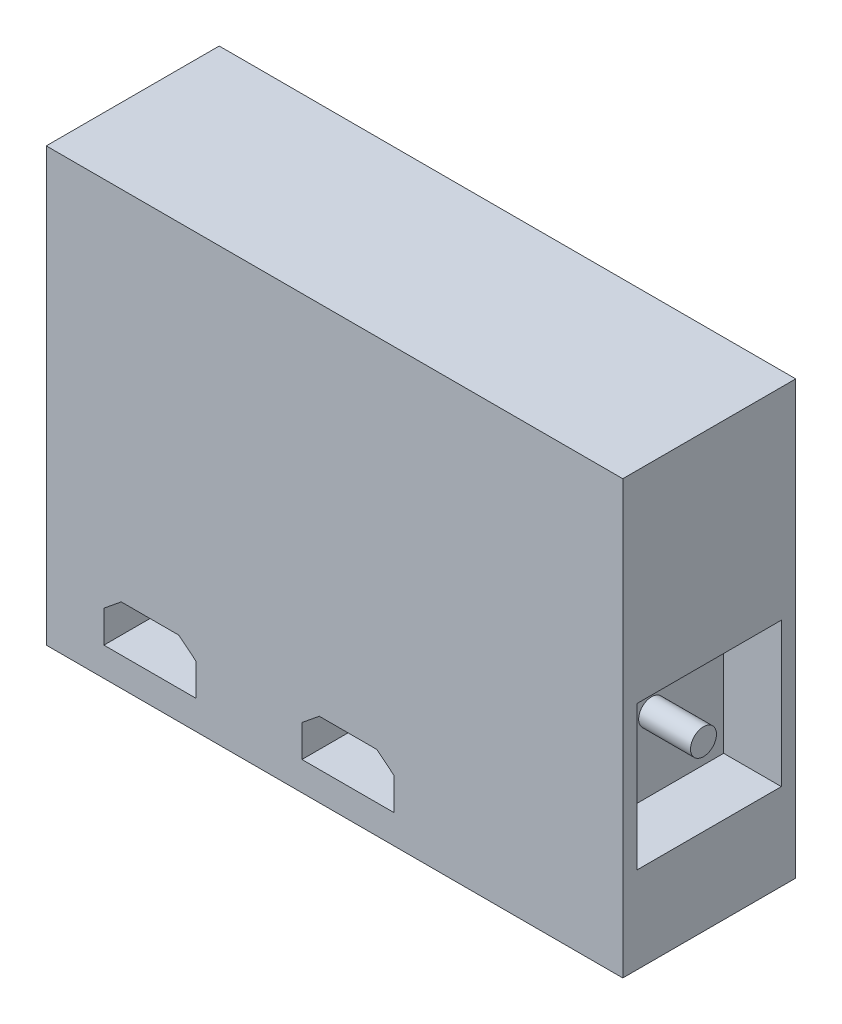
from build123d import *

# Parameters (mm, degrees)
SKETCH1_W          = 100
SKETCH1_H          = 75
BASE_EXTRUDE_DEPTH = 30
CUT_EXTRUDE1_DEPTH = 20
SKETCH6_W          = 25
SKETCH6_H          = 25
SKETCH6_R          = 2.25
CUT_EXTRUDE4_DEPTH = 10
SKETCH7_R          = 2.25
CUT_EXTRUDE5_DEPTH = 1


with BuildPart() as part:
    # Sketch1 → Base-Extrude (new body)
    with BuildSketch(Plane.XY):
        Rectangle(SKETCH1_W, SKETCH1_H)
    extrude(amount=BASE_EXTRUDE_DEPTH)

    # Sketch2 → Cut-Extrude1 (cut)
    with BuildSketch(Plane.XY.offset(30)):
        Polygon((-40, -26.94262182), (-40, -32.5), (-24, -32.5), (-24, -26.94262182), (-27, -24.5), (-37, -24.5), align=None)
        Polygon((-2.647451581, -24.5), (-5.647451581, -26.94262182), (-5.647451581, -32.5), (10.352548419, -32.5), (10.352548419, -26.94262182), (7.352548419, -24.5), align=None)
    extrude(amount=-CUT_EXTRUDE1_DEPTH, mode=Mode.SUBTRACT)

    # Sketch6 → Cut-Extrude4 (cut)
    with BuildSketch(Plane(origin=(50, 6.66134459, 56.803428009), x_dir=(0, 0, -1), z_dir=(1, 0, 0))):
        with Locations((41.803428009, -16.66134459)):
            Rectangle(SKETCH6_W, SKETCH6_H)
        with Locations((41.803428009, -16.66134459)):
            Circle(SKETCH6_R, mode=Mode.SUBTRACT)
    extrude(amount=-CUT_EXTRUDE4_DEPTH, mode=Mode.SUBTRACT)

    # Sketch7 → Cut-Extrude5 (cut)
    with BuildSketch(Plane(origin=(50, 0, 0), x_dir=(0, 0, -1), z_dir=(1, 0, 0))):
        with Locations((-15, -10)):
            Circle(SKETCH7_R)
    extrude(amount=-CUT_EXTRUDE5_DEPTH, mode=Mode.SUBTRACT)


solid = part.part
